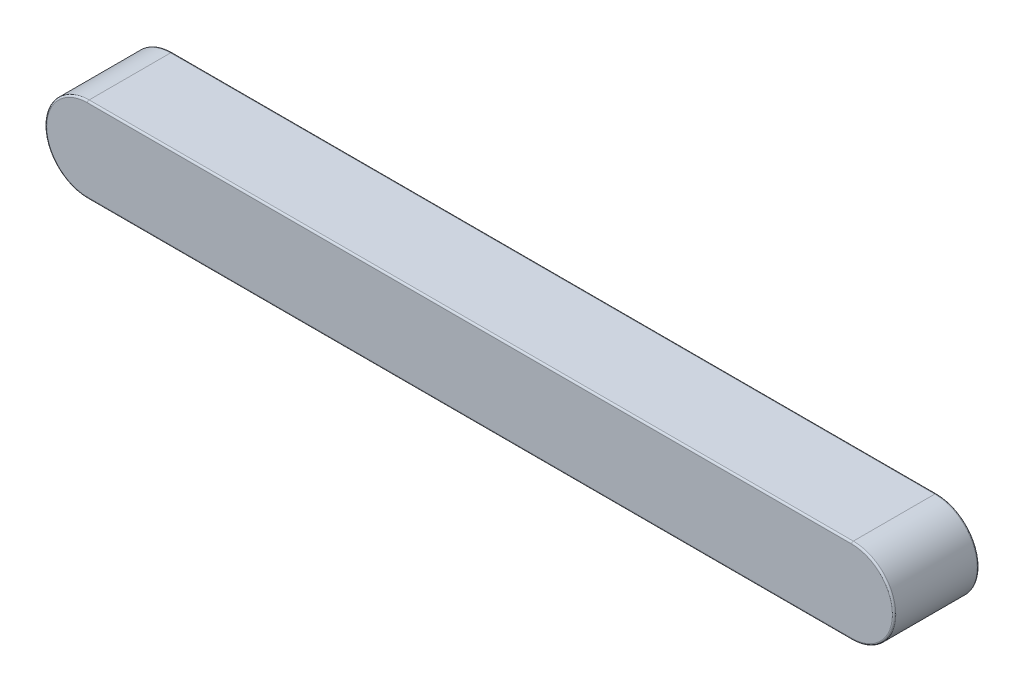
ISO-10303-21;
HEADER;
FILE_DESCRIPTION(('STEP AP214'),'2;1');
FILE_NAME('part.step','',(''),(''),'','','');
FILE_SCHEMA(('AUTOMOTIVE_DESIGN { 1 0 10303 214 1 1 1 1 }'));
ENDSEC;
DATA;
#1=APPLICATION_CONTEXT('core data for automotive mechanical design processes');
#2=APPLICATION_PROTOCOL_DEFINITION('international standard','automotive_design',2000,#1);
#3=PRODUCT_CONTEXT('',#1,'mechanical');
#4=PRODUCT('Part','Part','',(#3));
#5=PRODUCT_RELATED_PRODUCT_CATEGORY('part','',(#4));
#6=PRODUCT_DEFINITION_FORMATION('','',#4);
#7=PRODUCT_DEFINITION_CONTEXT('part definition',#1,'design');
#8=PRODUCT_DEFINITION('design','',#6,#7);
#9=PRODUCT_DEFINITION_SHAPE('','',#8);
#10=(LENGTH_UNIT() NAMED_UNIT(*) SI_UNIT(.MILLI.,.METRE.));
#11=(NAMED_UNIT(*) PLANE_ANGLE_UNIT() SI_UNIT($,.RADIAN.));
#12=(NAMED_UNIT(*) SI_UNIT($,.STERADIAN.) SOLID_ANGLE_UNIT());
#13=UNCERTAINTY_MEASURE_WITH_UNIT(LENGTH_MEASURE(1.E-05),#10,'distance_accuracy_value','');
#14=(GEOMETRIC_REPRESENTATION_CONTEXT(3) GLOBAL_UNCERTAINTY_ASSIGNED_CONTEXT((#13)) GLOBAL_UNIT_ASSIGNED_CONTEXT((#10,
#11,#12)) REPRESENTATION_CONTEXT('',''));
#15=CARTESIAN_POINT('',(0.,0.,0.));
#16=DIRECTION('',(0.,0.,1.));
#17=DIRECTION('',(1.,0.,0.));
#18=AXIS2_PLACEMENT_3D('',#15,#16,#17);
#19=CARTESIAN_POINT('',(0.,0.,0.));
#20=DIRECTION('',(0.,0.,1.));
#21=DIRECTION('',(1.,0.,0.));
#22=AXIS2_PLACEMENT_3D('',#19,#20,#21);
#23=PLANE('',#22);
#24=DIRECTION('',(1.,0.,0.));
#25=VECTOR('',#24,1.);
#26=CARTESIAN_POINT('',(11.25,-2.4,0.));
#27=LINE('',#26,#25);
#28=CARTESIAN_POINT('',(-22.5,-2.4,0.));
#29=VERTEX_POINT('',#28);
#30=CARTESIAN_POINT('',(22.5,-2.4,0.));
#31=VERTEX_POINT('',#30);
#32=EDGE_CURVE('E80',#29,#31,#27,.T.);
#33=ORIENTED_EDGE('',*,*,#32,.F.);
#34=CARTESIAN_POINT('',(-22.5,0.,0.));
#35=DIRECTION('',(0.,0.,1.));
#36=DIRECTION('',(0.,1.,0.));
#37=AXIS2_PLACEMENT_3D('',#34,#35,#36);
#38=CIRCLE('',#37,2.4);
#39=CARTESIAN_POINT('',(-22.5,2.4,0.));
#40=VERTEX_POINT('',#39);
#41=EDGE_CURVE('E112',#40,#29,#38,.T.);
#42=ORIENTED_EDGE('',*,*,#41,.F.);
#43=DIRECTION('',(-1.,0.,0.));
#44=VECTOR('',#43,1.);
#45=CARTESIAN_POINT('',(-11.25,2.39999999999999,0.));
#46=LINE('',#45,#44);
#47=CARTESIAN_POINT('',(22.5,2.4,0.));
#48=VERTEX_POINT('',#47);
#49=EDGE_CURVE('E95',#48,#40,#46,.T.);
#50=ORIENTED_EDGE('',*,*,#49,.F.);
#51=CARTESIAN_POINT('',(22.5,0.,0.));
#52=DIRECTION('',(0.,0.,1.));
#53=DIRECTION('',(0.,-1.,0.));
#54=AXIS2_PLACEMENT_3D('',#51,#52,#53);
#55=CIRCLE('',#54,2.4);
#56=EDGE_CURVE('E93',#31,#48,#55,.T.);
#57=ORIENTED_EDGE('',*,*,#56,.F.);
#58=EDGE_LOOP('',(#33,#42,#50,#57));
#59=FACE_BOUND('',#58,.T.);
#60=ADVANCED_FACE('F16',(#59),#23,.F.);
#61=CARTESIAN_POINT('',(11.25,-2.4,0.1));
#62=DIRECTION('',(1.,0.,0.));
#63=DIRECTION('',(0.,0.,-1.));
#64=AXIS2_PLACEMENT_3D('',#61,#62,#63);
#65=CYLINDRICAL_SURFACE('',#64,0.1);
#66=CARTESIAN_POINT('',(22.5,-2.4,0.1));
#67=DIRECTION('',(1.,0.,0.));
#68=DIRECTION('',(0.,-1.,0.));
#69=AXIS2_PLACEMENT_3D('',#66,#67,#68);
#70=CIRCLE('',#69,0.1);
#71=CARTESIAN_POINT('',(22.5,-2.5,0.1));
#72=VERTEX_POINT('',#71);
#73=EDGE_CURVE('E84',#72,#31,#70,.T.);
#74=ORIENTED_EDGE('',*,*,#73,.F.);
#75=DIRECTION('',(1.,0.,0.));
#76=VECTOR('',#75,1.);
#77=CARTESIAN_POINT('',(22.5,-2.5,0.1));
#78=LINE('',#77,#76);
#79=CARTESIAN_POINT('',(-22.5,-2.5,0.1));
#80=VERTEX_POINT('',#79);
#81=EDGE_CURVE('E123',#80,#72,#78,.T.);
#82=ORIENTED_EDGE('',*,*,#81,.F.);
#83=CARTESIAN_POINT('',(-22.5,-2.4,0.1));
#84=DIRECTION('',(1.,0.,0.));
#85=DIRECTION('',(0.,-1.,0.));
#86=AXIS2_PLACEMENT_3D('',#83,#84,#85);
#87=CIRCLE('',#86,0.1);
#88=EDGE_CURVE('E87',#29,#80,#87,.F.);
#89=ORIENTED_EDGE('',*,*,#88,.F.);
#90=ORIENTED_EDGE('',*,*,#32,.T.);
#91=EDGE_LOOP('',(#74,#82,#89,#90));
#92=FACE_BOUND('',#91,.T.);
#93=ADVANCED_FACE('F82',(#92),#65,.T.);
#94=CARTESIAN_POINT('',(22.5,0.,0.1));
#95=DIRECTION('',(0.,0.,1.));
#96=DIRECTION('',(1.,0.,0.));
#97=AXIS2_PLACEMENT_3D('',#94,#95,#96);
#98=TOROIDAL_SURFACE('',#97,2.4,0.1);
#99=CARTESIAN_POINT('',(22.5,2.40000000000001,0.1));
#100=DIRECTION('',(-1.,0.,0.));
#101=DIRECTION('',(0.,-1.,0.));
#102=AXIS2_PLACEMENT_3D('',#99,#100,#101);
#103=CIRCLE('',#102,0.1);
#104=CARTESIAN_POINT('',(22.5,2.5,0.1));
#105=VERTEX_POINT('',#104);
#106=EDGE_CURVE('E98',#105,#48,#103,.T.);
#107=ORIENTED_EDGE('',*,*,#106,.F.);
#108=CARTESIAN_POINT('',(22.5,0.,0.1));
#109=DIRECTION('',(0.,0.,1.));
#110=DIRECTION('',(1.,0.,0.));
#111=AXIS2_PLACEMENT_3D('',#108,#109,#110);
#112=CIRCLE('',#111,2.5);
#113=EDGE_CURVE('E103',#72,#105,#112,.T.);
#114=ORIENTED_EDGE('',*,*,#113,.F.);
#115=ORIENTED_EDGE('',*,*,#73,.T.);
#116=ORIENTED_EDGE('',*,*,#56,.T.);
#117=EDGE_LOOP('',(#107,#114,#115,#116));
#118=FACE_BOUND('',#117,.T.);
#119=ADVANCED_FACE('F101',(#118),#98,.T.);
#120=CARTESIAN_POINT('',(-11.25,2.4,0.1));
#121=DIRECTION('',(-1.,0.,0.));
#122=DIRECTION('',(0.,-1.,0.));
#123=AXIS2_PLACEMENT_3D('',#120,#121,#122);
#124=CYLINDRICAL_SURFACE('',#123,0.1);
#125=ORIENTED_EDGE('',*,*,#106,.T.);
#126=ORIENTED_EDGE('',*,*,#49,.T.);
#127=CARTESIAN_POINT('',(-22.5,2.4,0.1));
#128=DIRECTION('',(-1.,0.,0.));
#129=DIRECTION('',(0.,1.,0.));
#130=AXIS2_PLACEMENT_3D('',#127,#128,#129);
#131=CIRCLE('',#130,0.1);
#132=CARTESIAN_POINT('',(-22.5,2.5,0.1));
#133=VERTEX_POINT('',#132);
#134=EDGE_CURVE('E124',#133,#40,#131,.T.);
#135=ORIENTED_EDGE('',*,*,#134,.F.);
#136=DIRECTION('',(1.,0.,0.));
#137=VECTOR('',#136,1.);
#138=CARTESIAN_POINT('',(-22.5,2.5,0.1));
#139=LINE('',#138,#137);
#140=EDGE_CURVE('E278',#105,#133,#139,.F.);
#141=ORIENTED_EDGE('',*,*,#140,.F.);
#142=EDGE_LOOP('',(#125,#126,#135,#141));
#143=FACE_BOUND('',#142,.T.);
#144=ADVANCED_FACE('F164',(#143),#124,.T.);
#145=CARTESIAN_POINT('',(-22.5,0.,0.1));
#146=DIRECTION('',(0.,0.,1.));
#147=DIRECTION('',(1.,0.,0.));
#148=AXIS2_PLACEMENT_3D('',#145,#146,#147);
#149=TOROIDAL_SURFACE('',#148,2.4,0.1);
#150=ORIENTED_EDGE('',*,*,#134,.T.);
#151=ORIENTED_EDGE('',*,*,#41,.T.);
#152=ORIENTED_EDGE('',*,*,#88,.T.);
#153=CARTESIAN_POINT('',(-22.5,0.,0.1));
#154=DIRECTION('',(0.,0.,1.));
#155=DIRECTION('',(1.,0.,0.));
#156=AXIS2_PLACEMENT_3D('',#153,#154,#155);
#157=CIRCLE('',#156,2.5);
#158=EDGE_CURVE('E128',#133,#80,#157,.T.);
#159=ORIENTED_EDGE('',*,*,#158,.F.);
#160=EDGE_LOOP('',(#150,#151,#152,#159));
#161=FACE_BOUND('',#160,.T.);
#162=ADVANCED_FACE('F126',(#161),#149,.T.);
#163=CARTESIAN_POINT('',(22.5,-2.5,0.));
#164=DIRECTION('',(0.,-1.,0.));
#165=DIRECTION('',(0.,0.,-1.));
#166=AXIS2_PLACEMENT_3D('',#163,#164,#165);
#167=PLANE('',#166);
#168=DIRECTION('',(-1.,0.,0.));
#169=VECTOR('',#168,1.);
#170=CARTESIAN_POINT('',(11.25,-2.5,4.9));
#171=LINE('',#170,#169);
#172=CARTESIAN_POINT('',(-22.5,-2.5,4.9));
#173=VERTEX_POINT('',#172);
#174=CARTESIAN_POINT('',(22.5,-2.5,4.9));
#175=VERTEX_POINT('',#174);
#176=EDGE_CURVE('E262',#173,#175,#171,.F.);
#177=ORIENTED_EDGE('',*,*,#176,.F.);
#178=DIRECTION('',(0.,0.,1.));
#179=VECTOR('',#178,1.);
#180=CARTESIAN_POINT('',(-22.5,-2.5,0.));
#181=LINE('',#180,#179);
#182=EDGE_CURVE('E269',#80,#173,#181,.T.);
#183=ORIENTED_EDGE('',*,*,#182,.F.);
#184=ORIENTED_EDGE('',*,*,#81,.T.);
#185=DIRECTION('',(0.,0.,1.));
#186=VECTOR('',#185,1.);
#187=CARTESIAN_POINT('',(22.5,-2.5,0.));
#188=LINE('',#187,#186);
#189=EDGE_CURVE('E143',#175,#72,#188,.F.);
#190=ORIENTED_EDGE('',*,*,#189,.F.);
#191=EDGE_LOOP('',(#177,#183,#184,#190));
#192=FACE_BOUND('',#191,.T.);
#193=ADVANCED_FACE('F163',(#192),#167,.T.);
#194=CARTESIAN_POINT('',(22.5,0.,0.));
#195=DIRECTION('',(0.,0.,1.));
#196=DIRECTION('',(1.,0.,0.));
#197=AXIS2_PLACEMENT_3D('',#194,#195,#196);
#198=CYLINDRICAL_SURFACE('',#197,2.5);
#199=CARTESIAN_POINT('',(22.5,0.,4.9));
#200=DIRECTION('',(0.,0.,-1.));
#201=DIRECTION('',(-1.,0.,0.));
#202=AXIS2_PLACEMENT_3D('',#199,#200,#201);
#203=CIRCLE('',#202,2.5);
#204=CARTESIAN_POINT('',(22.5,2.5,4.9));
#205=VERTEX_POINT('',#204);
#206=EDGE_CURVE('E236',#175,#205,#203,.F.);
#207=ORIENTED_EDGE('',*,*,#206,.F.);
#208=ORIENTED_EDGE('',*,*,#189,.T.);
#209=ORIENTED_EDGE('',*,*,#113,.T.);
#210=DIRECTION('',(0.,0.,1.));
#211=VECTOR('',#210,1.);
#212=CARTESIAN_POINT('',(22.5,2.5,0.));
#213=LINE('',#212,#211);
#214=EDGE_CURVE('E275',#205,#105,#213,.F.);
#215=ORIENTED_EDGE('',*,*,#214,.F.);
#216=EDGE_LOOP('',(#207,#208,#209,#215));
#217=FACE_BOUND('',#216,.T.);
#218=ADVANCED_FACE('F288',(#217),#198,.T.);
#219=CARTESIAN_POINT('',(-22.5,2.5,0.));
#220=DIRECTION('',(0.,1.,0.));
#221=DIRECTION('',(0.,0.,1.));
#222=AXIS2_PLACEMENT_3D('',#219,#220,#221);
#223=PLANE('',#222);
#224=DIRECTION('',(1.,0.,0.));
#225=VECTOR('',#224,1.);
#226=CARTESIAN_POINT('',(-11.25,2.5,4.9));
#227=LINE('',#226,#225);
#228=CARTESIAN_POINT('',(-22.5,2.5,4.9));
#229=VERTEX_POINT('',#228);
#230=EDGE_CURVE('E230',#205,#229,#227,.F.);
#231=ORIENTED_EDGE('',*,*,#230,.F.);
#232=ORIENTED_EDGE('',*,*,#214,.T.);
#233=ORIENTED_EDGE('',*,*,#140,.T.);
#234=DIRECTION('',(0.,0.,1.));
#235=VECTOR('',#234,1.);
#236=CARTESIAN_POINT('',(-22.5,2.5,0.));
#237=LINE('',#236,#235);
#238=EDGE_CURVE('E267',#229,#133,#237,.F.);
#239=ORIENTED_EDGE('',*,*,#238,.F.);
#240=EDGE_LOOP('',(#231,#232,#233,#239));
#241=FACE_BOUND('',#240,.T.);
#242=ADVANCED_FACE('F296',(#241),#223,.T.);
#243=CARTESIAN_POINT('',(-22.5,0.,0.));
#244=DIRECTION('',(0.,0.,1.));
#245=DIRECTION('',(1.,0.,0.));
#246=AXIS2_PLACEMENT_3D('',#243,#244,#245);
#247=CYLINDRICAL_SURFACE('',#246,2.5);
#248=CARTESIAN_POINT('',(-22.5,0.,4.9));
#249=DIRECTION('',(0.,0.,-1.));
#250=DIRECTION('',(-1.,0.,0.));
#251=AXIS2_PLACEMENT_3D('',#248,#249,#250);
#252=CIRCLE('',#251,2.5);
#253=EDGE_CURVE('E226',#229,#173,#252,.F.);
#254=ORIENTED_EDGE('',*,*,#253,.F.);
#255=ORIENTED_EDGE('',*,*,#238,.T.);
#256=ORIENTED_EDGE('',*,*,#158,.T.);
#257=ORIENTED_EDGE('',*,*,#182,.T.);
#258=EDGE_LOOP('',(#254,#255,#256,#257));
#259=FACE_BOUND('',#258,.T.);
#260=ADVANCED_FACE('F294',(#259),#247,.T.);
#261=CARTESIAN_POINT('',(11.25,-2.4,4.9));
#262=DIRECTION('',(-1.,0.,0.));
#263=DIRECTION('',(0.,0.,1.));
#264=AXIS2_PLACEMENT_3D('',#261,#262,#263);
#265=CYLINDRICAL_SURFACE('',#264,0.1);
#266=CARTESIAN_POINT('',(-22.5,-2.4,4.9));
#267=DIRECTION('',(-1.,0.,0.));
#268=DIRECTION('',(0.,-1.,0.));
#269=AXIS2_PLACEMENT_3D('',#266,#267,#268);
#270=CIRCLE('',#269,0.1);
#271=CARTESIAN_POINT('',(-22.5,-2.4,5.));
#272=VERTEX_POINT('',#271);
#273=EDGE_CURVE('E213',#173,#272,#270,.T.);
#274=ORIENTED_EDGE('',*,*,#273,.F.);
#275=ORIENTED_EDGE('',*,*,#176,.T.);
#276=CARTESIAN_POINT('',(22.5,-2.4,4.9));
#277=DIRECTION('',(-1.,0.,0.));
#278=DIRECTION('',(0.,-1.,0.));
#279=AXIS2_PLACEMENT_3D('',#276,#277,#278);
#280=CIRCLE('',#279,0.1);
#281=CARTESIAN_POINT('',(22.5,-2.4,5.));
#282=VERTEX_POINT('',#281);
#283=EDGE_CURVE('E254',#282,#175,#280,.F.);
#284=ORIENTED_EDGE('',*,*,#283,.F.);
#285=DIRECTION('',(1.,0.,0.));
#286=VECTOR('',#285,1.);
#287=CARTESIAN_POINT('',(0.,-2.4,5.));
#288=LINE('',#287,#286);
#289=EDGE_CURVE('E208',#272,#282,#288,.T.);
#290=ORIENTED_EDGE('',*,*,#289,.F.);
#291=EDGE_LOOP('',(#274,#275,#284,#290));
#292=FACE_BOUND('',#291,.T.);
#293=ADVANCED_FACE('F248',(#292),#265,.T.);
#294=CARTESIAN_POINT('',(22.5,0.,4.9));
#295=DIRECTION('',(0.,0.,-1.));
#296=DIRECTION('',(-1.,0.,0.));
#297=AXIS2_PLACEMENT_3D('',#294,#295,#296);
#298=TOROIDAL_SURFACE('',#297,2.4,0.1);
#299=ORIENTED_EDGE('',*,*,#283,.T.);
#300=ORIENTED_EDGE('',*,*,#206,.T.);
#301=CARTESIAN_POINT('',(22.5,2.40000000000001,4.9));
#302=DIRECTION('',(1.,0.,0.));
#303=DIRECTION('',(0.,1.,0.));
#304=AXIS2_PLACEMENT_3D('',#301,#302,#303);
#305=CIRCLE('',#304,0.1);
#306=CARTESIAN_POINT('',(22.5,2.4,5.));
#307=VERTEX_POINT('',#306);
#308=EDGE_CURVE('E233',#307,#205,#305,.F.);
#309=ORIENTED_EDGE('',*,*,#308,.F.);
#310=CARTESIAN_POINT('',(22.5,0.,5.));
#311=DIRECTION('',(0.,0.,-1.));
#312=DIRECTION('',(0.,1.,0.));
#313=AXIS2_PLACEMENT_3D('',#310,#311,#312);
#314=CIRCLE('',#313,2.4);
#315=EDGE_CURVE('E290',#282,#307,#314,.F.);
#316=ORIENTED_EDGE('',*,*,#315,.F.);
#317=EDGE_LOOP('',(#299,#300,#309,#316));
#318=FACE_BOUND('',#317,.T.);
#319=ADVANCED_FACE('F244',(#318),#298,.T.);
#320=CARTESIAN_POINT('',(-11.25,2.4,4.9));
#321=DIRECTION('',(1.,0.,0.));
#322=DIRECTION('',(0.,1.,0.));
#323=AXIS2_PLACEMENT_3D('',#320,#321,#322);
#324=CYLINDRICAL_SURFACE('',#323,0.1);
#325=CARTESIAN_POINT('',(-22.5,2.4,4.9));
#326=DIRECTION('',(1.,0.,0.));
#327=DIRECTION('',(0.,1.,0.));
#328=AXIS2_PLACEMENT_3D('',#325,#326,#327);
#329=CIRCLE('',#328,0.1);
#330=CARTESIAN_POINT('',(-22.5,2.4,5.));
#331=VERTEX_POINT('',#330);
#332=EDGE_CURVE('E36',#331,#229,#329,.F.);
#333=ORIENTED_EDGE('',*,*,#332,.F.);
#334=DIRECTION('',(1.,0.,0.));
#335=VECTOR('',#334,1.);
#336=CARTESIAN_POINT('',(0.,2.4,5.));
#337=LINE('',#336,#335);
#338=EDGE_CURVE('E28',#307,#331,#337,.F.);
#339=ORIENTED_EDGE('',*,*,#338,.F.);
#340=ORIENTED_EDGE('',*,*,#308,.T.);
#341=ORIENTED_EDGE('',*,*,#230,.T.);
#342=EDGE_LOOP('',(#333,#339,#340,#341));
#343=FACE_BOUND('',#342,.T.);
#344=ADVANCED_FACE('F182',(#343),#324,.T.);
#345=CARTESIAN_POINT('',(-22.5,0.,4.9));
#346=DIRECTION('',(0.,0.,-1.));
#347=DIRECTION('',(-1.,0.,0.));
#348=AXIS2_PLACEMENT_3D('',#345,#346,#347);
#349=TOROIDAL_SURFACE('',#348,2.4,0.1);
#350=ORIENTED_EDGE('',*,*,#273,.T.);
#351=CARTESIAN_POINT('',(-22.5,0.,5.));
#352=DIRECTION('',(0.,0.,-1.));
#353=DIRECTION('',(0.,-1.,0.));
#354=AXIS2_PLACEMENT_3D('',#351,#352,#353);
#355=CIRCLE('',#354,2.4);
#356=EDGE_CURVE('E11',#331,#272,#355,.F.);
#357=ORIENTED_EDGE('',*,*,#356,.F.);
#358=ORIENTED_EDGE('',*,*,#332,.T.);
#359=ORIENTED_EDGE('',*,*,#253,.T.);
#360=EDGE_LOOP('',(#350,#357,#358,#359));
#361=FACE_BOUND('',#360,.T.);
#362=ADVANCED_FACE('F176',(#361),#349,.T.);
#363=CARTESIAN_POINT('',(0.,0.,5.));
#364=DIRECTION('',(0.,0.,1.));
#365=DIRECTION('',(1.,0.,0.));
#366=AXIS2_PLACEMENT_3D('',#363,#364,#365);
#367=PLANE('',#366);
#368=ORIENTED_EDGE('',*,*,#338,.T.);
#369=ORIENTED_EDGE('',*,*,#356,.T.);
#370=ORIENTED_EDGE('',*,*,#289,.T.);
#371=ORIENTED_EDGE('',*,*,#315,.T.);
#372=EDGE_LOOP('',(#368,#369,#370,#371));
#373=FACE_BOUND('',#372,.T.);
#374=ADVANCED_FACE('F174',(#373),#367,.T.);
#375=CLOSED_SHELL('',(#60,#93,#119,#144,#162,#193,#218,#242,#260,#293,#319,#344,#362,#374));
#376=MANIFOLD_SOLID_BREP('B1',#375);
#377=ADVANCED_BREP_SHAPE_REPRESENTATION('',(#18,#376),#14);
#378=SHAPE_DEFINITION_REPRESENTATION(#9,#377);
ENDSEC;
END-ISO-10303-21;
